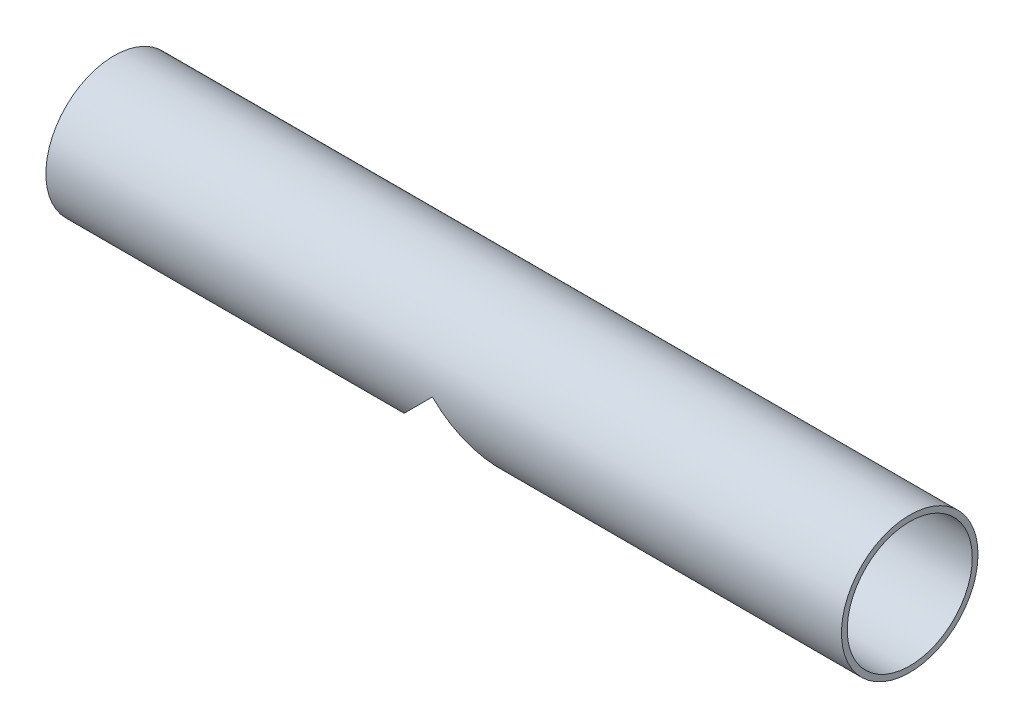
from build123d import *

# Parameters (mm, degrees)
ESQUISSE2_R             = 38.05
ESQUISSE2_R_2           = 34.85
ENL_V_MAT_EXTRU_1_DEPTH = 40


with BuildPart() as part:
    # Balayage1: sweep along a path in Esquisse1
    with BuildLine(Plane.XY) as balayage1_path:
        Line((0, 0), (443.5, 0))
    # Esquisse2 → Balayage1 (sweep)
    with BuildSketch(Plane(origin=(0, 0, 0), x_dir=(0, 0, -1), z_dir=(1, 0, 0))):
        Circle(ESQUISSE2_R)
        Circle(ESQUISSE2_R_2, mode=Mode.SUBTRACT)
    sweep(path=balayage1_path.line)

    # Esquisse3 → Enl_v. mat.-Extru.1 (cut, symmetric)
    with BuildSketch(Plane.XY):
        Polygon((215.4524078, 0), (170.591210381, -44.861197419), (260.313605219, -44.861197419), align=None)
    extrude(amount=ENL_V_MAT_EXTRU_1_DEPTH, both=True, mode=Mode.SUBTRACT)


solid = part.part
